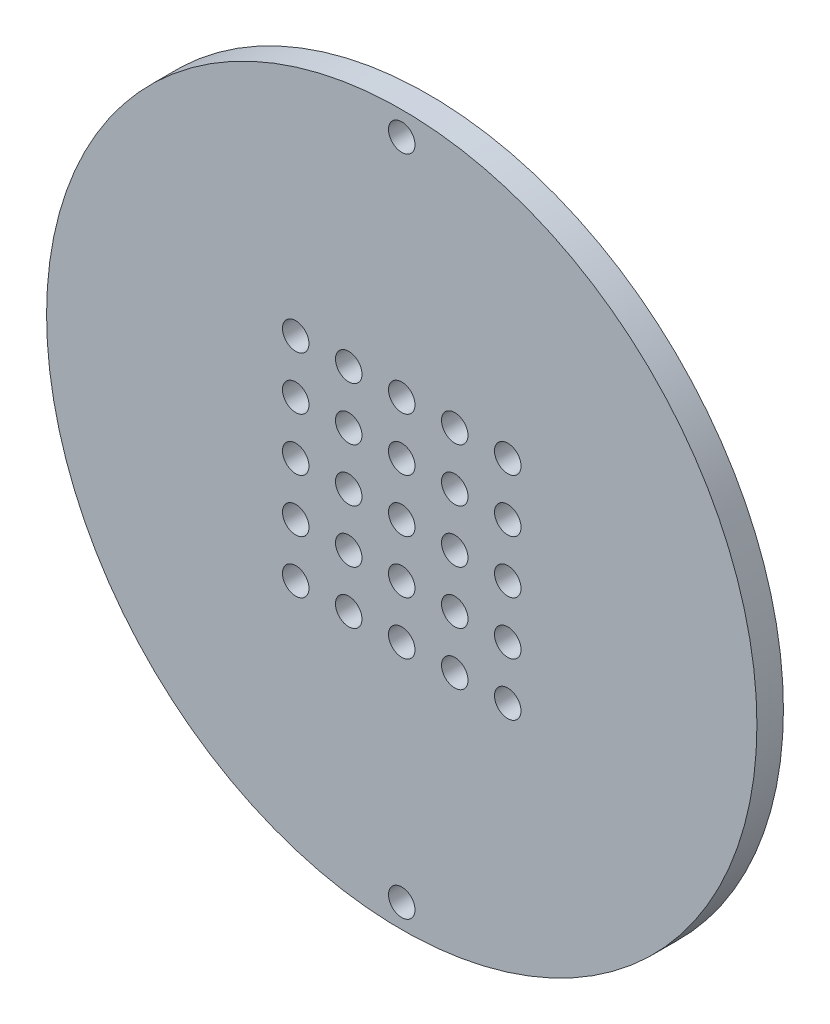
ISO-10303-21;
HEADER;
FILE_DESCRIPTION(('STEP AP214'),'2;1');
FILE_NAME('part.step','',(''),(''),'','','');
FILE_SCHEMA(('AUTOMOTIVE_DESIGN { 1 0 10303 214 1 1 1 1 }'));
ENDSEC;
DATA;
#1=APPLICATION_CONTEXT('core data for automotive mechanical design processes');
#2=APPLICATION_PROTOCOL_DEFINITION('international standard','automotive_design',2000,#1);
#3=PRODUCT_CONTEXT('',#1,'mechanical');
#4=PRODUCT('Part','Part','',(#3));
#5=PRODUCT_RELATED_PRODUCT_CATEGORY('part','',(#4));
#6=PRODUCT_DEFINITION_FORMATION('','',#4);
#7=PRODUCT_DEFINITION_CONTEXT('part definition',#1,'design');
#8=PRODUCT_DEFINITION('design','',#6,#7);
#9=PRODUCT_DEFINITION_SHAPE('','',#8);
#10=(LENGTH_UNIT() NAMED_UNIT(*) SI_UNIT(.MILLI.,.METRE.));
#11=(NAMED_UNIT(*) PLANE_ANGLE_UNIT() SI_UNIT($,.RADIAN.));
#12=(NAMED_UNIT(*) SI_UNIT($,.STERADIAN.) SOLID_ANGLE_UNIT());
#13=UNCERTAINTY_MEASURE_WITH_UNIT(LENGTH_MEASURE(1.E-05),#10,'distance_accuracy_value','');
#14=(GEOMETRIC_REPRESENTATION_CONTEXT(3) GLOBAL_UNCERTAINTY_ASSIGNED_CONTEXT((#13)) GLOBAL_UNIT_ASSIGNED_CONTEXT((#10,
#11,#12)) REPRESENTATION_CONTEXT('',''));
#15=CARTESIAN_POINT('',(0.,0.,0.));
#16=DIRECTION('',(0.,0.,1.));
#17=DIRECTION('',(1.,0.,0.));
#18=AXIS2_PLACEMENT_3D('',#15,#16,#17);
#19=CARTESIAN_POINT('',(0.,0.,6.35));
#20=DIRECTION('',(0.,0.,1.));
#21=DIRECTION('',(1.,0.,0.));
#22=AXIS2_PLACEMENT_3D('',#19,#20,#21);
#23=PLANE('',#22);
#24=CARTESIAN_POINT('',(0.,79.375,6.35));
#25=DIRECTION('',(0.,0.,1.));
#26=DIRECTION('',(1.,0.,0.));
#27=AXIS2_PLACEMENT_3D('',#24,#25,#26);
#28=CIRCLE('',#27,3.175);
#29=CARTESIAN_POINT('',(3.175,79.375,6.35));
#30=VERTEX_POINT('',#29);
#31=EDGE_CURVE('E107',#30,#30,#28,.F.);
#32=ORIENTED_EDGE('',*,*,#31,.T.);
#33=EDGE_LOOP('',(#32));
#34=FACE_BOUND('',#33,.T.);
#35=CARTESIAN_POINT('',(0.,-79.375,6.35));
#36=DIRECTION('',(0.,0.,1.));
#37=DIRECTION('',(1.,0.,0.));
#38=AXIS2_PLACEMENT_3D('',#35,#36,#37);
#39=CIRCLE('',#38,3.175);
#40=CARTESIAN_POINT('',(3.175,-79.375,6.35));
#41=VERTEX_POINT('',#40);
#42=EDGE_CURVE('E110',#41,#41,#39,.F.);
#43=ORIENTED_EDGE('',*,*,#42,.T.);
#44=EDGE_LOOP('',(#43));
#45=FACE_BOUND('',#44,.T.);
#46=CARTESIAN_POINT('',(0.,0.,6.35));
#47=DIRECTION('',(0.,0.,1.));
#48=DIRECTION('',(1.,0.,0.));
#49=AXIS2_PLACEMENT_3D('',#46,#47,#48);
#50=CIRCLE('',#49,3.175);
#51=CARTESIAN_POINT('',(3.175,0.,6.35));
#52=VERTEX_POINT('',#51);
#53=EDGE_CURVE('E113',#52,#52,#50,.F.);
#54=ORIENTED_EDGE('',*,*,#53,.T.);
#55=EDGE_LOOP('',(#54));
#56=FACE_BOUND('',#55,.T.);
#57=CARTESIAN_POINT('',(0.,-12.7,6.35));
#58=DIRECTION('',(0.,0.,1.));
#59=DIRECTION('',(1.,0.,0.));
#60=AXIS2_PLACEMENT_3D('',#57,#58,#59);
#61=CIRCLE('',#60,3.175);
#62=CARTESIAN_POINT('',(3.175,-12.7,6.35));
#63=VERTEX_POINT('',#62);
#64=EDGE_CURVE('E116',#63,#63,#61,.F.);
#65=ORIENTED_EDGE('',*,*,#64,.T.);
#66=EDGE_LOOP('',(#65));
#67=FACE_BOUND('',#66,.T.);
#68=CARTESIAN_POINT('',(0.,-25.4,6.35));
#69=DIRECTION('',(0.,0.,1.));
#70=DIRECTION('',(1.,0.,0.));
#71=AXIS2_PLACEMENT_3D('',#68,#69,#70);
#72=CIRCLE('',#71,3.175);
#73=CARTESIAN_POINT('',(3.175,-25.4,6.35));
#74=VERTEX_POINT('',#73);
#75=EDGE_CURVE('E119',#74,#74,#72,.F.);
#76=ORIENTED_EDGE('',*,*,#75,.T.);
#77=EDGE_LOOP('',(#76));
#78=FACE_BOUND('',#77,.T.);
#79=CARTESIAN_POINT('',(12.7,0.,6.35));
#80=DIRECTION('',(0.,0.,1.));
#81=DIRECTION('',(1.,0.,0.));
#82=AXIS2_PLACEMENT_3D('',#79,#80,#81);
#83=CIRCLE('',#82,3.175);
#84=CARTESIAN_POINT('',(15.875,0.,6.35));
#85=VERTEX_POINT('',#84);
#86=EDGE_CURVE('E122',#85,#85,#83,.F.);
#87=ORIENTED_EDGE('',*,*,#86,.T.);
#88=EDGE_LOOP('',(#87));
#89=FACE_BOUND('',#88,.T.);
#90=CARTESIAN_POINT('',(12.7,-12.7,6.35));
#91=DIRECTION('',(0.,0.,1.));
#92=DIRECTION('',(1.,0.,0.));
#93=AXIS2_PLACEMENT_3D('',#90,#91,#92);
#94=CIRCLE('',#93,3.175);
#95=CARTESIAN_POINT('',(15.875,-12.7,6.35));
#96=VERTEX_POINT('',#95);
#97=EDGE_CURVE('E125',#96,#96,#94,.F.);
#98=ORIENTED_EDGE('',*,*,#97,.T.);
#99=EDGE_LOOP('',(#98));
#100=FACE_BOUND('',#99,.T.);
#101=CARTESIAN_POINT('',(12.7,-25.4,6.35));
#102=DIRECTION('',(0.,0.,1.));
#103=DIRECTION('',(1.,0.,0.));
#104=AXIS2_PLACEMENT_3D('',#101,#102,#103);
#105=CIRCLE('',#104,3.175);
#106=CARTESIAN_POINT('',(15.875,-25.4,6.35));
#107=VERTEX_POINT('',#106);
#108=EDGE_CURVE('E128',#107,#107,#105,.F.);
#109=ORIENTED_EDGE('',*,*,#108,.T.);
#110=EDGE_LOOP('',(#109));
#111=FACE_BOUND('',#110,.T.);
#112=CARTESIAN_POINT('',(25.4,0.,6.35));
#113=DIRECTION('',(0.,0.,1.));
#114=DIRECTION('',(1.,0.,0.));
#115=AXIS2_PLACEMENT_3D('',#112,#113,#114);
#116=CIRCLE('',#115,3.175);
#117=CARTESIAN_POINT('',(28.575,0.,6.35));
#118=VERTEX_POINT('',#117);
#119=EDGE_CURVE('E131',#118,#118,#116,.F.);
#120=ORIENTED_EDGE('',*,*,#119,.T.);
#121=EDGE_LOOP('',(#120));
#122=FACE_BOUND('',#121,.T.);
#123=CARTESIAN_POINT('',(25.4,-12.7,6.35));
#124=DIRECTION('',(0.,0.,1.));
#125=DIRECTION('',(1.,0.,0.));
#126=AXIS2_PLACEMENT_3D('',#123,#124,#125);
#127=CIRCLE('',#126,3.175);
#128=CARTESIAN_POINT('',(28.575,-12.7,6.35));
#129=VERTEX_POINT('',#128);
#130=EDGE_CURVE('E134',#129,#129,#127,.F.);
#131=ORIENTED_EDGE('',*,*,#130,.T.);
#132=EDGE_LOOP('',(#131));
#133=FACE_BOUND('',#132,.T.);
#134=CARTESIAN_POINT('',(25.4,-25.4,6.35));
#135=DIRECTION('',(0.,0.,1.));
#136=DIRECTION('',(1.,0.,0.));
#137=AXIS2_PLACEMENT_3D('',#134,#135,#136);
#138=CIRCLE('',#137,3.175);
#139=CARTESIAN_POINT('',(28.575,-25.4,6.35));
#140=VERTEX_POINT('',#139);
#141=EDGE_CURVE('E137',#140,#140,#138,.F.);
#142=ORIENTED_EDGE('',*,*,#141,.T.);
#143=EDGE_LOOP('',(#142));
#144=FACE_BOUND('',#143,.T.);
#145=CARTESIAN_POINT('',(0.,12.7,6.35));
#146=DIRECTION('',(0.,0.,1.));
#147=DIRECTION('',(1.,0.,0.));
#148=AXIS2_PLACEMENT_3D('',#145,#146,#147);
#149=CIRCLE('',#148,3.175);
#150=CARTESIAN_POINT('',(3.175,12.7,6.35));
#151=VERTEX_POINT('',#150);
#152=EDGE_CURVE('E140',#151,#151,#149,.F.);
#153=ORIENTED_EDGE('',*,*,#152,.T.);
#154=EDGE_LOOP('',(#153));
#155=FACE_BOUND('',#154,.T.);
#156=CARTESIAN_POINT('',(0.,25.4,6.35));
#157=DIRECTION('',(0.,0.,1.));
#158=DIRECTION('',(1.,0.,0.));
#159=AXIS2_PLACEMENT_3D('',#156,#157,#158);
#160=CIRCLE('',#159,3.175);
#161=CARTESIAN_POINT('',(3.175,25.4,6.35));
#162=VERTEX_POINT('',#161);
#163=EDGE_CURVE('E143',#162,#162,#160,.F.);
#164=ORIENTED_EDGE('',*,*,#163,.T.);
#165=EDGE_LOOP('',(#164));
#166=FACE_BOUND('',#165,.T.);
#167=CARTESIAN_POINT('',(12.7,12.7,6.35));
#168=DIRECTION('',(0.,0.,1.));
#169=DIRECTION('',(1.,0.,0.));
#170=AXIS2_PLACEMENT_3D('',#167,#168,#169);
#171=CIRCLE('',#170,3.175);
#172=CARTESIAN_POINT('',(15.875,12.7,6.35));
#173=VERTEX_POINT('',#172);
#174=EDGE_CURVE('E146',#173,#173,#171,.F.);
#175=ORIENTED_EDGE('',*,*,#174,.T.);
#176=EDGE_LOOP('',(#175));
#177=FACE_BOUND('',#176,.T.);
#178=CARTESIAN_POINT('',(12.7,25.4,6.35));
#179=DIRECTION('',(0.,0.,1.));
#180=DIRECTION('',(1.,0.,0.));
#181=AXIS2_PLACEMENT_3D('',#178,#179,#180);
#182=CIRCLE('',#181,3.175);
#183=CARTESIAN_POINT('',(15.875,25.4,6.35));
#184=VERTEX_POINT('',#183);
#185=EDGE_CURVE('E149',#184,#184,#182,.F.);
#186=ORIENTED_EDGE('',*,*,#185,.T.);
#187=EDGE_LOOP('',(#186));
#188=FACE_BOUND('',#187,.T.);
#189=CARTESIAN_POINT('',(25.4,12.7,6.35));
#190=DIRECTION('',(0.,0.,1.));
#191=DIRECTION('',(1.,0.,0.));
#192=AXIS2_PLACEMENT_3D('',#189,#190,#191);
#193=CIRCLE('',#192,3.175);
#194=CARTESIAN_POINT('',(28.575,12.7,6.35));
#195=VERTEX_POINT('',#194);
#196=EDGE_CURVE('E152',#195,#195,#193,.F.);
#197=ORIENTED_EDGE('',*,*,#196,.T.);
#198=EDGE_LOOP('',(#197));
#199=FACE_BOUND('',#198,.T.);
#200=CARTESIAN_POINT('',(25.4,25.4,6.35));
#201=DIRECTION('',(0.,0.,1.));
#202=DIRECTION('',(1.,0.,0.));
#203=AXIS2_PLACEMENT_3D('',#200,#201,#202);
#204=CIRCLE('',#203,3.175);
#205=CARTESIAN_POINT('',(28.575,25.4,6.35));
#206=VERTEX_POINT('',#205);
#207=EDGE_CURVE('E155',#206,#206,#204,.F.);
#208=ORIENTED_EDGE('',*,*,#207,.T.);
#209=EDGE_LOOP('',(#208));
#210=FACE_BOUND('',#209,.T.);
#211=CARTESIAN_POINT('',(-12.7,25.4,6.35));
#212=DIRECTION('',(0.,0.,1.));
#213=DIRECTION('',(1.,0.,0.));
#214=AXIS2_PLACEMENT_3D('',#211,#212,#213);
#215=CIRCLE('',#214,3.175);
#216=CARTESIAN_POINT('',(-9.525,25.4,6.35));
#217=VERTEX_POINT('',#216);
#218=EDGE_CURVE('E158',#217,#217,#215,.F.);
#219=ORIENTED_EDGE('',*,*,#218,.T.);
#220=EDGE_LOOP('',(#219));
#221=FACE_BOUND('',#220,.T.);
#222=CARTESIAN_POINT('',(-12.7,12.7,6.35));
#223=DIRECTION('',(0.,0.,1.));
#224=DIRECTION('',(1.,0.,0.));
#225=AXIS2_PLACEMENT_3D('',#222,#223,#224);
#226=CIRCLE('',#225,3.175);
#227=CARTESIAN_POINT('',(-9.525,12.7,6.35));
#228=VERTEX_POINT('',#227);
#229=EDGE_CURVE('E161',#228,#228,#226,.F.);
#230=ORIENTED_EDGE('',*,*,#229,.T.);
#231=EDGE_LOOP('',(#230));
#232=FACE_BOUND('',#231,.T.);
#233=CARTESIAN_POINT('',(-12.7,0.,6.35));
#234=DIRECTION('',(0.,0.,1.));
#235=DIRECTION('',(1.,0.,0.));
#236=AXIS2_PLACEMENT_3D('',#233,#234,#235);
#237=CIRCLE('',#236,3.175);
#238=CARTESIAN_POINT('',(-9.525,0.,6.35));
#239=VERTEX_POINT('',#238);
#240=EDGE_CURVE('E164',#239,#239,#237,.F.);
#241=ORIENTED_EDGE('',*,*,#240,.T.);
#242=EDGE_LOOP('',(#241));
#243=FACE_BOUND('',#242,.T.);
#244=CARTESIAN_POINT('',(-12.7,-12.7,6.35));
#245=DIRECTION('',(0.,0.,1.));
#246=DIRECTION('',(1.,0.,0.));
#247=AXIS2_PLACEMENT_3D('',#244,#245,#246);
#248=CIRCLE('',#247,3.175);
#249=CARTESIAN_POINT('',(-9.525,-12.7,6.35));
#250=VERTEX_POINT('',#249);
#251=EDGE_CURVE('E167',#250,#250,#248,.F.);
#252=ORIENTED_EDGE('',*,*,#251,.T.);
#253=EDGE_LOOP('',(#252));
#254=FACE_BOUND('',#253,.T.);
#255=CARTESIAN_POINT('',(-12.7,-25.4,6.35));
#256=DIRECTION('',(0.,0.,1.));
#257=DIRECTION('',(1.,0.,0.));
#258=AXIS2_PLACEMENT_3D('',#255,#256,#257);
#259=CIRCLE('',#258,3.175);
#260=CARTESIAN_POINT('',(-9.525,-25.4,6.35));
#261=VERTEX_POINT('',#260);
#262=EDGE_CURVE('E170',#261,#261,#259,.F.);
#263=ORIENTED_EDGE('',*,*,#262,.T.);
#264=EDGE_LOOP('',(#263));
#265=FACE_BOUND('',#264,.T.);
#266=CARTESIAN_POINT('',(-25.4,25.4,6.35));
#267=DIRECTION('',(0.,0.,1.));
#268=DIRECTION('',(1.,0.,0.));
#269=AXIS2_PLACEMENT_3D('',#266,#267,#268);
#270=CIRCLE('',#269,3.175);
#271=CARTESIAN_POINT('',(-22.225,25.4,6.35));
#272=VERTEX_POINT('',#271);
#273=EDGE_CURVE('E173',#272,#272,#270,.F.);
#274=ORIENTED_EDGE('',*,*,#273,.T.);
#275=EDGE_LOOP('',(#274));
#276=FACE_BOUND('',#275,.T.);
#277=CARTESIAN_POINT('',(-25.4,12.7,6.35));
#278=DIRECTION('',(0.,0.,1.));
#279=DIRECTION('',(1.,0.,0.));
#280=AXIS2_PLACEMENT_3D('',#277,#278,#279);
#281=CIRCLE('',#280,3.175);
#282=CARTESIAN_POINT('',(-22.225,12.7,6.35));
#283=VERTEX_POINT('',#282);
#284=EDGE_CURVE('E176',#283,#283,#281,.F.);
#285=ORIENTED_EDGE('',*,*,#284,.T.);
#286=EDGE_LOOP('',(#285));
#287=FACE_BOUND('',#286,.T.);
#288=CARTESIAN_POINT('',(-25.4,0.,6.35));
#289=DIRECTION('',(0.,0.,1.));
#290=DIRECTION('',(1.,0.,0.));
#291=AXIS2_PLACEMENT_3D('',#288,#289,#290);
#292=CIRCLE('',#291,3.175);
#293=CARTESIAN_POINT('',(-22.225,0.,6.35));
#294=VERTEX_POINT('',#293);
#295=EDGE_CURVE('E179',#294,#294,#292,.F.);
#296=ORIENTED_EDGE('',*,*,#295,.T.);
#297=EDGE_LOOP('',(#296));
#298=FACE_BOUND('',#297,.T.);
#299=CARTESIAN_POINT('',(-25.4,-12.7,6.35));
#300=DIRECTION('',(0.,0.,1.));
#301=DIRECTION('',(1.,0.,0.));
#302=AXIS2_PLACEMENT_3D('',#299,#300,#301);
#303=CIRCLE('',#302,3.175);
#304=CARTESIAN_POINT('',(-22.225,-12.7,6.35));
#305=VERTEX_POINT('',#304);
#306=EDGE_CURVE('E182',#305,#305,#303,.F.);
#307=ORIENTED_EDGE('',*,*,#306,.T.);
#308=EDGE_LOOP('',(#307));
#309=FACE_BOUND('',#308,.T.);
#310=CARTESIAN_POINT('',(-25.4,-25.4,6.35));
#311=DIRECTION('',(0.,0.,1.));
#312=DIRECTION('',(1.,0.,0.));
#313=AXIS2_PLACEMENT_3D('',#310,#311,#312);
#314=CIRCLE('',#313,3.175);
#315=CARTESIAN_POINT('',(-22.225,-25.4,6.35));
#316=VERTEX_POINT('',#315);
#317=EDGE_CURVE('E184',#316,#316,#314,.F.);
#318=ORIENTED_EDGE('',*,*,#317,.T.);
#319=EDGE_LOOP('',(#318));
#320=FACE_BOUND('',#319,.T.);
#321=CARTESIAN_POINT('',(0.,0.,6.35));
#322=DIRECTION('',(0.,0.,1.));
#323=DIRECTION('',(1.,0.,0.));
#324=AXIS2_PLACEMENT_3D('',#321,#322,#323);
#325=CIRCLE('',#324,85.09);
#326=CARTESIAN_POINT('',(85.09,0.,6.35));
#327=VERTEX_POINT('',#326);
#328=EDGE_CURVE('E18',#327,#327,#325,.F.);
#329=ORIENTED_EDGE('',*,*,#328,.F.);
#330=EDGE_LOOP('',(#329));
#331=FACE_BOUND('',#330,.T.);
#332=ADVANCED_FACE('F15',(#34,#45,#56,#67,#78,#89,#100,#111,#122,#133,#144,#155,#166,#177,#188,
#199,#210,#221,#232,#243,#254,#265,#276,#287,#298,#309,#320,#331),#23,.T.);
#333=CARTESIAN_POINT('',(0.,0.,0.));
#334=DIRECTION('',(0.,0.,1.));
#335=DIRECTION('',(1.,0.,0.));
#336=AXIS2_PLACEMENT_3D('',#333,#334,#335);
#337=CYLINDRICAL_SURFACE('',#336,85.09);
#338=CARTESIAN_POINT('',(0.,0.,0.));
#339=DIRECTION('',(0.,0.,1.));
#340=DIRECTION('',(1.,0.,0.));
#341=AXIS2_PLACEMENT_3D('',#338,#339,#340);
#342=CIRCLE('',#341,85.09);
#343=CARTESIAN_POINT('',(85.09,0.,0.));
#344=VERTEX_POINT('',#343);
#345=EDGE_CURVE('E104',#344,#344,#342,.T.);
#346=ORIENTED_EDGE('',*,*,#345,.T.);
#347=EDGE_LOOP('',(#346));
#348=FACE_BOUND('',#347,.T.);
#349=ORIENTED_EDGE('',*,*,#328,.T.);
#350=EDGE_LOOP('',(#349));
#351=FACE_BOUND('',#350,.T.);
#352=ADVANCED_FACE('F191',(#348,#351),#337,.T.);
#353=CARTESIAN_POINT('',(-25.4,-25.4,0.));
#354=DIRECTION('',(0.,0.,1.));
#355=DIRECTION('',(1.,0.,0.));
#356=AXIS2_PLACEMENT_3D('',#353,#354,#355);
#357=CYLINDRICAL_SURFACE('',#356,3.175);
#358=CARTESIAN_POINT('',(-25.4,-25.4,0.));
#359=DIRECTION('',(0.,0.,1.));
#360=DIRECTION('',(1.,0.,0.));
#361=AXIS2_PLACEMENT_3D('',#358,#359,#360);
#362=CIRCLE('',#361,3.175);
#363=CARTESIAN_POINT('',(-22.225,-25.4,0.));
#364=VERTEX_POINT('',#363);
#365=EDGE_CURVE('E101',#364,#364,#362,.F.);
#366=ORIENTED_EDGE('',*,*,#365,.T.);
#367=EDGE_LOOP('',(#366));
#368=FACE_BOUND('',#367,.T.);
#369=ORIENTED_EDGE('',*,*,#317,.F.);
#370=EDGE_LOOP('',(#369));
#371=FACE_BOUND('',#370,.T.);
#372=ADVANCED_FACE('F199',(#368,#371),#357,.F.);
#373=CARTESIAN_POINT('',(-25.4,-12.7,0.));
#374=DIRECTION('',(0.,0.,1.));
#375=DIRECTION('',(1.,0.,0.));
#376=AXIS2_PLACEMENT_3D('',#373,#374,#375);
#377=CYLINDRICAL_SURFACE('',#376,3.175);
#378=CARTESIAN_POINT('',(-25.4,-12.7,0.));
#379=DIRECTION('',(0.,0.,1.));
#380=DIRECTION('',(1.,0.,0.));
#381=AXIS2_PLACEMENT_3D('',#378,#379,#380);
#382=CIRCLE('',#381,3.175);
#383=CARTESIAN_POINT('',(-22.225,-12.7,0.));
#384=VERTEX_POINT('',#383);
#385=EDGE_CURVE('E98',#384,#384,#382,.F.);
#386=ORIENTED_EDGE('',*,*,#385,.T.);
#387=EDGE_LOOP('',(#386));
#388=FACE_BOUND('',#387,.T.);
#389=ORIENTED_EDGE('',*,*,#306,.F.);
#390=EDGE_LOOP('',(#389));
#391=FACE_BOUND('',#390,.T.);
#392=ADVANCED_FACE('F308',(#388,#391),#377,.F.);
#393=CARTESIAN_POINT('',(-25.4,0.,0.));
#394=DIRECTION('',(0.,0.,1.));
#395=DIRECTION('',(1.,0.,0.));
#396=AXIS2_PLACEMENT_3D('',#393,#394,#395);
#397=CYLINDRICAL_SURFACE('',#396,3.175);
#398=CARTESIAN_POINT('',(-25.4,0.,0.));
#399=DIRECTION('',(0.,0.,1.));
#400=DIRECTION('',(1.,0.,0.));
#401=AXIS2_PLACEMENT_3D('',#398,#399,#400);
#402=CIRCLE('',#401,3.175);
#403=CARTESIAN_POINT('',(-22.225,0.,0.));
#404=VERTEX_POINT('',#403);
#405=EDGE_CURVE('E95',#404,#404,#402,.F.);
#406=ORIENTED_EDGE('',*,*,#405,.T.);
#407=EDGE_LOOP('',(#406));
#408=FACE_BOUND('',#407,.T.);
#409=ORIENTED_EDGE('',*,*,#295,.F.);
#410=EDGE_LOOP('',(#409));
#411=FACE_BOUND('',#410,.T.);
#412=ADVANCED_FACE('F304',(#408,#411),#397,.F.);
#413=CARTESIAN_POINT('',(-25.4,12.7,0.));
#414=DIRECTION('',(0.,0.,1.));
#415=DIRECTION('',(1.,0.,0.));
#416=AXIS2_PLACEMENT_3D('',#413,#414,#415);
#417=CYLINDRICAL_SURFACE('',#416,3.175);
#418=CARTESIAN_POINT('',(-25.4,12.7,0.));
#419=DIRECTION('',(0.,0.,1.));
#420=DIRECTION('',(1.,0.,0.));
#421=AXIS2_PLACEMENT_3D('',#418,#419,#420);
#422=CIRCLE('',#421,3.175);
#423=CARTESIAN_POINT('',(-22.225,12.7,0.));
#424=VERTEX_POINT('',#423);
#425=EDGE_CURVE('E92',#424,#424,#422,.F.);
#426=ORIENTED_EDGE('',*,*,#425,.T.);
#427=EDGE_LOOP('',(#426));
#428=FACE_BOUND('',#427,.T.);
#429=ORIENTED_EDGE('',*,*,#284,.F.);
#430=EDGE_LOOP('',(#429));
#431=FACE_BOUND('',#430,.T.);
#432=ADVANCED_FACE('F300',(#428,#431),#417,.F.);
#433=CARTESIAN_POINT('',(-25.4,25.4,0.));
#434=DIRECTION('',(0.,0.,1.));
#435=DIRECTION('',(1.,0.,0.));
#436=AXIS2_PLACEMENT_3D('',#433,#434,#435);
#437=CYLINDRICAL_SURFACE('',#436,3.175);
#438=CARTESIAN_POINT('',(-25.4,25.4,0.));
#439=DIRECTION('',(0.,0.,1.));
#440=DIRECTION('',(1.,0.,0.));
#441=AXIS2_PLACEMENT_3D('',#438,#439,#440);
#442=CIRCLE('',#441,3.175);
#443=CARTESIAN_POINT('',(-22.225,25.4,0.));
#444=VERTEX_POINT('',#443);
#445=EDGE_CURVE('E89',#444,#444,#442,.F.);
#446=ORIENTED_EDGE('',*,*,#445,.T.);
#447=EDGE_LOOP('',(#446));
#448=FACE_BOUND('',#447,.T.);
#449=ORIENTED_EDGE('',*,*,#273,.F.);
#450=EDGE_LOOP('',(#449));
#451=FACE_BOUND('',#450,.T.);
#452=ADVANCED_FACE('F296',(#448,#451),#437,.F.);
#453=CARTESIAN_POINT('',(-12.7,-25.4,0.));
#454=DIRECTION('',(0.,0.,1.));
#455=DIRECTION('',(1.,0.,0.));
#456=AXIS2_PLACEMENT_3D('',#453,#454,#455);
#457=CYLINDRICAL_SURFACE('',#456,3.175);
#458=CARTESIAN_POINT('',(-12.7,-25.4,0.));
#459=DIRECTION('',(0.,0.,1.));
#460=DIRECTION('',(1.,0.,0.));
#461=AXIS2_PLACEMENT_3D('',#458,#459,#460);
#462=CIRCLE('',#461,3.175);
#463=CARTESIAN_POINT('',(-9.525,-25.4,0.));
#464=VERTEX_POINT('',#463);
#465=EDGE_CURVE('E86',#464,#464,#462,.F.);
#466=ORIENTED_EDGE('',*,*,#465,.T.);
#467=EDGE_LOOP('',(#466));
#468=FACE_BOUND('',#467,.T.);
#469=ORIENTED_EDGE('',*,*,#262,.F.);
#470=EDGE_LOOP('',(#469));
#471=FACE_BOUND('',#470,.T.);
#472=ADVANCED_FACE('F292',(#468,#471),#457,.F.);
#473=CARTESIAN_POINT('',(-12.7,-12.7,0.));
#474=DIRECTION('',(0.,0.,1.));
#475=DIRECTION('',(1.,0.,0.));
#476=AXIS2_PLACEMENT_3D('',#473,#474,#475);
#477=CYLINDRICAL_SURFACE('',#476,3.175);
#478=CARTESIAN_POINT('',(-12.7,-12.7,0.));
#479=DIRECTION('',(0.,0.,1.));
#480=DIRECTION('',(1.,0.,0.));
#481=AXIS2_PLACEMENT_3D('',#478,#479,#480);
#482=CIRCLE('',#481,3.175);
#483=CARTESIAN_POINT('',(-9.525,-12.7,0.));
#484=VERTEX_POINT('',#483);
#485=EDGE_CURVE('E83',#484,#484,#482,.F.);
#486=ORIENTED_EDGE('',*,*,#485,.T.);
#487=EDGE_LOOP('',(#486));
#488=FACE_BOUND('',#487,.T.);
#489=ORIENTED_EDGE('',*,*,#251,.F.);
#490=EDGE_LOOP('',(#489));
#491=FACE_BOUND('',#490,.T.);
#492=ADVANCED_FACE('F288',(#488,#491),#477,.F.);
#493=CARTESIAN_POINT('',(-12.7,0.,0.));
#494=DIRECTION('',(0.,0.,1.));
#495=DIRECTION('',(1.,0.,0.));
#496=AXIS2_PLACEMENT_3D('',#493,#494,#495);
#497=CYLINDRICAL_SURFACE('',#496,3.175);
#498=CARTESIAN_POINT('',(-12.7,0.,0.));
#499=DIRECTION('',(0.,0.,1.));
#500=DIRECTION('',(1.,0.,0.));
#501=AXIS2_PLACEMENT_3D('',#498,#499,#500);
#502=CIRCLE('',#501,3.175);
#503=CARTESIAN_POINT('',(-9.525,0.,0.));
#504=VERTEX_POINT('',#503);
#505=EDGE_CURVE('E80',#504,#504,#502,.F.);
#506=ORIENTED_EDGE('',*,*,#505,.T.);
#507=EDGE_LOOP('',(#506));
#508=FACE_BOUND('',#507,.T.);
#509=ORIENTED_EDGE('',*,*,#240,.F.);
#510=EDGE_LOOP('',(#509));
#511=FACE_BOUND('',#510,.T.);
#512=ADVANCED_FACE('F284',(#508,#511),#497,.F.);
#513=CARTESIAN_POINT('',(-12.7,12.7,0.));
#514=DIRECTION('',(0.,0.,1.));
#515=DIRECTION('',(1.,0.,0.));
#516=AXIS2_PLACEMENT_3D('',#513,#514,#515);
#517=CYLINDRICAL_SURFACE('',#516,3.175);
#518=CARTESIAN_POINT('',(-12.7,12.7,0.));
#519=DIRECTION('',(0.,0.,1.));
#520=DIRECTION('',(1.,0.,0.));
#521=AXIS2_PLACEMENT_3D('',#518,#519,#520);
#522=CIRCLE('',#521,3.175);
#523=CARTESIAN_POINT('',(-9.525,12.7,0.));
#524=VERTEX_POINT('',#523);
#525=EDGE_CURVE('E77',#524,#524,#522,.F.);
#526=ORIENTED_EDGE('',*,*,#525,.T.);
#527=EDGE_LOOP('',(#526));
#528=FACE_BOUND('',#527,.T.);
#529=ORIENTED_EDGE('',*,*,#229,.F.);
#530=EDGE_LOOP('',(#529));
#531=FACE_BOUND('',#530,.T.);
#532=ADVANCED_FACE('F280',(#528,#531),#517,.F.);
#533=CARTESIAN_POINT('',(-12.7,25.4,0.));
#534=DIRECTION('',(0.,0.,1.));
#535=DIRECTION('',(1.,0.,0.));
#536=AXIS2_PLACEMENT_3D('',#533,#534,#535);
#537=CYLINDRICAL_SURFACE('',#536,3.175);
#538=CARTESIAN_POINT('',(-12.7,25.4,0.));
#539=DIRECTION('',(0.,0.,1.));
#540=DIRECTION('',(1.,0.,0.));
#541=AXIS2_PLACEMENT_3D('',#538,#539,#540);
#542=CIRCLE('',#541,3.175);
#543=CARTESIAN_POINT('',(-9.525,25.4,0.));
#544=VERTEX_POINT('',#543);
#545=EDGE_CURVE('E74',#544,#544,#542,.F.);
#546=ORIENTED_EDGE('',*,*,#545,.T.);
#547=EDGE_LOOP('',(#546));
#548=FACE_BOUND('',#547,.T.);
#549=ORIENTED_EDGE('',*,*,#218,.F.);
#550=EDGE_LOOP('',(#549));
#551=FACE_BOUND('',#550,.T.);
#552=ADVANCED_FACE('F276',(#548,#551),#537,.F.);
#553=CARTESIAN_POINT('',(25.4,25.4,0.));
#554=DIRECTION('',(0.,0.,1.));
#555=DIRECTION('',(1.,0.,0.));
#556=AXIS2_PLACEMENT_3D('',#553,#554,#555);
#557=CYLINDRICAL_SURFACE('',#556,3.175);
#558=CARTESIAN_POINT('',(25.4,25.4,0.));
#559=DIRECTION('',(0.,0.,1.));
#560=DIRECTION('',(1.,0.,0.));
#561=AXIS2_PLACEMENT_3D('',#558,#559,#560);
#562=CIRCLE('',#561,3.175);
#563=CARTESIAN_POINT('',(28.575,25.4,0.));
#564=VERTEX_POINT('',#563);
#565=EDGE_CURVE('E71',#564,#564,#562,.F.);
#566=ORIENTED_EDGE('',*,*,#565,.T.);
#567=EDGE_LOOP('',(#566));
#568=FACE_BOUND('',#567,.T.);
#569=ORIENTED_EDGE('',*,*,#207,.F.);
#570=EDGE_LOOP('',(#569));
#571=FACE_BOUND('',#570,.T.);
#572=ADVANCED_FACE('F272',(#568,#571),#557,.F.);
#573=CARTESIAN_POINT('',(25.4,12.7,0.));
#574=DIRECTION('',(0.,0.,1.));
#575=DIRECTION('',(1.,0.,0.));
#576=AXIS2_PLACEMENT_3D('',#573,#574,#575);
#577=CYLINDRICAL_SURFACE('',#576,3.175);
#578=CARTESIAN_POINT('',(25.4,12.7,0.));
#579=DIRECTION('',(0.,0.,1.));
#580=DIRECTION('',(1.,0.,0.));
#581=AXIS2_PLACEMENT_3D('',#578,#579,#580);
#582=CIRCLE('',#581,3.175);
#583=CARTESIAN_POINT('',(28.575,12.7,0.));
#584=VERTEX_POINT('',#583);
#585=EDGE_CURVE('E68',#584,#584,#582,.F.);
#586=ORIENTED_EDGE('',*,*,#585,.T.);
#587=EDGE_LOOP('',(#586));
#588=FACE_BOUND('',#587,.T.);
#589=ORIENTED_EDGE('',*,*,#196,.F.);
#590=EDGE_LOOP('',(#589));
#591=FACE_BOUND('',#590,.T.);
#592=ADVANCED_FACE('F268',(#588,#591),#577,.F.);
#593=CARTESIAN_POINT('',(12.7,25.4,0.));
#594=DIRECTION('',(0.,0.,1.));
#595=DIRECTION('',(1.,0.,0.));
#596=AXIS2_PLACEMENT_3D('',#593,#594,#595);
#597=CYLINDRICAL_SURFACE('',#596,3.175);
#598=CARTESIAN_POINT('',(12.7,25.4,0.));
#599=DIRECTION('',(0.,0.,1.));
#600=DIRECTION('',(1.,0.,0.));
#601=AXIS2_PLACEMENT_3D('',#598,#599,#600);
#602=CIRCLE('',#601,3.175);
#603=CARTESIAN_POINT('',(15.875,25.4,0.));
#604=VERTEX_POINT('',#603);
#605=EDGE_CURVE('E65',#604,#604,#602,.F.);
#606=ORIENTED_EDGE('',*,*,#605,.T.);
#607=EDGE_LOOP('',(#606));
#608=FACE_BOUND('',#607,.T.);
#609=ORIENTED_EDGE('',*,*,#185,.F.);
#610=EDGE_LOOP('',(#609));
#611=FACE_BOUND('',#610,.T.);
#612=ADVANCED_FACE('F264',(#608,#611),#597,.F.);
#613=CARTESIAN_POINT('',(12.7,12.7,0.));
#614=DIRECTION('',(0.,0.,1.));
#615=DIRECTION('',(1.,0.,0.));
#616=AXIS2_PLACEMENT_3D('',#613,#614,#615);
#617=CYLINDRICAL_SURFACE('',#616,3.175);
#618=CARTESIAN_POINT('',(12.7,12.7,0.));
#619=DIRECTION('',(0.,0.,1.));
#620=DIRECTION('',(1.,0.,0.));
#621=AXIS2_PLACEMENT_3D('',#618,#619,#620);
#622=CIRCLE('',#621,3.175);
#623=CARTESIAN_POINT('',(15.875,12.7,0.));
#624=VERTEX_POINT('',#623);
#625=EDGE_CURVE('E62',#624,#624,#622,.F.);
#626=ORIENTED_EDGE('',*,*,#625,.T.);
#627=EDGE_LOOP('',(#626));
#628=FACE_BOUND('',#627,.T.);
#629=ORIENTED_EDGE('',*,*,#174,.F.);
#630=EDGE_LOOP('',(#629));
#631=FACE_BOUND('',#630,.T.);
#632=ADVANCED_FACE('F260',(#628,#631),#617,.F.);
#633=CARTESIAN_POINT('',(0.,25.4,0.));
#634=DIRECTION('',(0.,0.,1.));
#635=DIRECTION('',(1.,0.,0.));
#636=AXIS2_PLACEMENT_3D('',#633,#634,#635);
#637=CYLINDRICAL_SURFACE('',#636,3.175);
#638=CARTESIAN_POINT('',(0.,25.4,0.));
#639=DIRECTION('',(0.,0.,1.));
#640=DIRECTION('',(1.,0.,0.));
#641=AXIS2_PLACEMENT_3D('',#638,#639,#640);
#642=CIRCLE('',#641,3.175);
#643=CARTESIAN_POINT('',(3.175,25.4,0.));
#644=VERTEX_POINT('',#643);
#645=EDGE_CURVE('E59',#644,#644,#642,.F.);
#646=ORIENTED_EDGE('',*,*,#645,.T.);
#647=EDGE_LOOP('',(#646));
#648=FACE_BOUND('',#647,.T.);
#649=ORIENTED_EDGE('',*,*,#163,.F.);
#650=EDGE_LOOP('',(#649));
#651=FACE_BOUND('',#650,.T.);
#652=ADVANCED_FACE('F256',(#648,#651),#637,.F.);
#653=CARTESIAN_POINT('',(0.,12.7,0.));
#654=DIRECTION('',(0.,0.,1.));
#655=DIRECTION('',(1.,0.,0.));
#656=AXIS2_PLACEMENT_3D('',#653,#654,#655);
#657=CYLINDRICAL_SURFACE('',#656,3.175);
#658=CARTESIAN_POINT('',(0.,12.7,0.));
#659=DIRECTION('',(0.,0.,1.));
#660=DIRECTION('',(1.,0.,0.));
#661=AXIS2_PLACEMENT_3D('',#658,#659,#660);
#662=CIRCLE('',#661,3.175);
#663=CARTESIAN_POINT('',(3.175,12.7,0.));
#664=VERTEX_POINT('',#663);
#665=EDGE_CURVE('E56',#664,#664,#662,.F.);
#666=ORIENTED_EDGE('',*,*,#665,.T.);
#667=EDGE_LOOP('',(#666));
#668=FACE_BOUND('',#667,.T.);
#669=ORIENTED_EDGE('',*,*,#152,.F.);
#670=EDGE_LOOP('',(#669));
#671=FACE_BOUND('',#670,.T.);
#672=ADVANCED_FACE('F252',(#668,#671),#657,.F.);
#673=CARTESIAN_POINT('',(25.4,-25.4,0.));
#674=DIRECTION('',(0.,0.,1.));
#675=DIRECTION('',(1.,0.,0.));
#676=AXIS2_PLACEMENT_3D('',#673,#674,#675);
#677=CYLINDRICAL_SURFACE('',#676,3.175);
#678=CARTESIAN_POINT('',(25.4,-25.4,0.));
#679=DIRECTION('',(0.,0.,1.));
#680=DIRECTION('',(1.,0.,0.));
#681=AXIS2_PLACEMENT_3D('',#678,#679,#680);
#682=CIRCLE('',#681,3.175);
#683=CARTESIAN_POINT('',(28.575,-25.4,0.));
#684=VERTEX_POINT('',#683);
#685=EDGE_CURVE('E53',#684,#684,#682,.F.);
#686=ORIENTED_EDGE('',*,*,#685,.T.);
#687=EDGE_LOOP('',(#686));
#688=FACE_BOUND('',#687,.T.);
#689=ORIENTED_EDGE('',*,*,#141,.F.);
#690=EDGE_LOOP('',(#689));
#691=FACE_BOUND('',#690,.T.);
#692=ADVANCED_FACE('F248',(#688,#691),#677,.F.);
#693=CARTESIAN_POINT('',(25.4,-12.7,0.));
#694=DIRECTION('',(0.,0.,1.));
#695=DIRECTION('',(1.,0.,0.));
#696=AXIS2_PLACEMENT_3D('',#693,#694,#695);
#697=CYLINDRICAL_SURFACE('',#696,3.175);
#698=CARTESIAN_POINT('',(25.4,-12.7,0.));
#699=DIRECTION('',(0.,0.,1.));
#700=DIRECTION('',(1.,0.,0.));
#701=AXIS2_PLACEMENT_3D('',#698,#699,#700);
#702=CIRCLE('',#701,3.175);
#703=CARTESIAN_POINT('',(28.575,-12.7,0.));
#704=VERTEX_POINT('',#703);
#705=EDGE_CURVE('E50',#704,#704,#702,.F.);
#706=ORIENTED_EDGE('',*,*,#705,.T.);
#707=EDGE_LOOP('',(#706));
#708=FACE_BOUND('',#707,.T.);
#709=ORIENTED_EDGE('',*,*,#130,.F.);
#710=EDGE_LOOP('',(#709));
#711=FACE_BOUND('',#710,.T.);
#712=ADVANCED_FACE('F244',(#708,#711),#697,.F.);
#713=CARTESIAN_POINT('',(25.4,0.,0.));
#714=DIRECTION('',(0.,0.,1.));
#715=DIRECTION('',(1.,0.,0.));
#716=AXIS2_PLACEMENT_3D('',#713,#714,#715);
#717=CYLINDRICAL_SURFACE('',#716,3.175);
#718=CARTESIAN_POINT('',(25.4,0.,0.));
#719=DIRECTION('',(0.,0.,1.));
#720=DIRECTION('',(1.,0.,0.));
#721=AXIS2_PLACEMENT_3D('',#718,#719,#720);
#722=CIRCLE('',#721,3.175);
#723=CARTESIAN_POINT('',(28.575,0.,0.));
#724=VERTEX_POINT('',#723);
#725=EDGE_CURVE('E47',#724,#724,#722,.F.);
#726=ORIENTED_EDGE('',*,*,#725,.T.);
#727=EDGE_LOOP('',(#726));
#728=FACE_BOUND('',#727,.T.);
#729=ORIENTED_EDGE('',*,*,#119,.F.);
#730=EDGE_LOOP('',(#729));
#731=FACE_BOUND('',#730,.T.);
#732=ADVANCED_FACE('F240',(#728,#731),#717,.F.);
#733=CARTESIAN_POINT('',(12.7,-25.4,0.));
#734=DIRECTION('',(0.,0.,1.));
#735=DIRECTION('',(1.,0.,0.));
#736=AXIS2_PLACEMENT_3D('',#733,#734,#735);
#737=CYLINDRICAL_SURFACE('',#736,3.175);
#738=CARTESIAN_POINT('',(12.7,-25.4,0.));
#739=DIRECTION('',(0.,0.,1.));
#740=DIRECTION('',(1.,0.,0.));
#741=AXIS2_PLACEMENT_3D('',#738,#739,#740);
#742=CIRCLE('',#741,3.175);
#743=CARTESIAN_POINT('',(15.875,-25.4,0.));
#744=VERTEX_POINT('',#743);
#745=EDGE_CURVE('E44',#744,#744,#742,.F.);
#746=ORIENTED_EDGE('',*,*,#745,.T.);
#747=EDGE_LOOP('',(#746));
#748=FACE_BOUND('',#747,.T.);
#749=ORIENTED_EDGE('',*,*,#108,.F.);
#750=EDGE_LOOP('',(#749));
#751=FACE_BOUND('',#750,.T.);
#752=ADVANCED_FACE('F236',(#748,#751),#737,.F.);
#753=CARTESIAN_POINT('',(12.7,-12.7,0.));
#754=DIRECTION('',(0.,0.,1.));
#755=DIRECTION('',(1.,0.,0.));
#756=AXIS2_PLACEMENT_3D('',#753,#754,#755);
#757=CYLINDRICAL_SURFACE('',#756,3.175);
#758=CARTESIAN_POINT('',(12.7,-12.7,0.));
#759=DIRECTION('',(0.,0.,1.));
#760=DIRECTION('',(1.,0.,0.));
#761=AXIS2_PLACEMENT_3D('',#758,#759,#760);
#762=CIRCLE('',#761,3.175);
#763=CARTESIAN_POINT('',(15.875,-12.7,0.));
#764=VERTEX_POINT('',#763);
#765=EDGE_CURVE('E41',#764,#764,#762,.F.);
#766=ORIENTED_EDGE('',*,*,#765,.T.);
#767=EDGE_LOOP('',(#766));
#768=FACE_BOUND('',#767,.T.);
#769=ORIENTED_EDGE('',*,*,#97,.F.);
#770=EDGE_LOOP('',(#769));
#771=FACE_BOUND('',#770,.T.);
#772=ADVANCED_FACE('F232',(#768,#771),#757,.F.);
#773=CARTESIAN_POINT('',(12.7,0.,0.));
#774=DIRECTION('',(0.,0.,1.));
#775=DIRECTION('',(1.,0.,0.));
#776=AXIS2_PLACEMENT_3D('',#773,#774,#775);
#777=CYLINDRICAL_SURFACE('',#776,3.175);
#778=CARTESIAN_POINT('',(12.7,0.,0.));
#779=DIRECTION('',(0.,0.,1.));
#780=DIRECTION('',(1.,0.,0.));
#781=AXIS2_PLACEMENT_3D('',#778,#779,#780);
#782=CIRCLE('',#781,3.175);
#783=CARTESIAN_POINT('',(15.875,0.,0.));
#784=VERTEX_POINT('',#783);
#785=EDGE_CURVE('E38',#784,#784,#782,.F.);
#786=ORIENTED_EDGE('',*,*,#785,.T.);
#787=EDGE_LOOP('',(#786));
#788=FACE_BOUND('',#787,.T.);
#789=ORIENTED_EDGE('',*,*,#86,.F.);
#790=EDGE_LOOP('',(#789));
#791=FACE_BOUND('',#790,.T.);
#792=ADVANCED_FACE('F228',(#788,#791),#777,.F.);
#793=CARTESIAN_POINT('',(0.,-25.4,0.));
#794=DIRECTION('',(0.,0.,1.));
#795=DIRECTION('',(1.,0.,0.));
#796=AXIS2_PLACEMENT_3D('',#793,#794,#795);
#797=CYLINDRICAL_SURFACE('',#796,3.175);
#798=CARTESIAN_POINT('',(0.,-25.4,0.));
#799=DIRECTION('',(0.,0.,1.));
#800=DIRECTION('',(1.,0.,0.));
#801=AXIS2_PLACEMENT_3D('',#798,#799,#800);
#802=CIRCLE('',#801,3.175);
#803=CARTESIAN_POINT('',(3.175,-25.4,0.));
#804=VERTEX_POINT('',#803);
#805=EDGE_CURVE('E35',#804,#804,#802,.F.);
#806=ORIENTED_EDGE('',*,*,#805,.T.);
#807=EDGE_LOOP('',(#806));
#808=FACE_BOUND('',#807,.T.);
#809=ORIENTED_EDGE('',*,*,#75,.F.);
#810=EDGE_LOOP('',(#809));
#811=FACE_BOUND('',#810,.T.);
#812=ADVANCED_FACE('F224',(#808,#811),#797,.F.);
#813=CARTESIAN_POINT('',(0.,-12.7,0.));
#814=DIRECTION('',(0.,0.,1.));
#815=DIRECTION('',(1.,0.,0.));
#816=AXIS2_PLACEMENT_3D('',#813,#814,#815);
#817=CYLINDRICAL_SURFACE('',#816,3.175);
#818=CARTESIAN_POINT('',(0.,-12.7,0.));
#819=DIRECTION('',(0.,0.,1.));
#820=DIRECTION('',(1.,0.,0.));
#821=AXIS2_PLACEMENT_3D('',#818,#819,#820);
#822=CIRCLE('',#821,3.175);
#823=CARTESIAN_POINT('',(3.175,-12.7,0.));
#824=VERTEX_POINT('',#823);
#825=EDGE_CURVE('E32',#824,#824,#822,.F.);
#826=ORIENTED_EDGE('',*,*,#825,.T.);
#827=EDGE_LOOP('',(#826));
#828=FACE_BOUND('',#827,.T.);
#829=ORIENTED_EDGE('',*,*,#64,.F.);
#830=EDGE_LOOP('',(#829));
#831=FACE_BOUND('',#830,.T.);
#832=ADVANCED_FACE('F220',(#828,#831),#817,.F.);
#833=CARTESIAN_POINT('',(0.,0.,0.));
#834=DIRECTION('',(0.,0.,1.));
#835=DIRECTION('',(1.,0.,0.));
#836=AXIS2_PLACEMENT_3D('',#833,#834,#835);
#837=CYLINDRICAL_SURFACE('',#836,3.175);
#838=CARTESIAN_POINT('',(0.,0.,0.));
#839=DIRECTION('',(0.,0.,1.));
#840=DIRECTION('',(1.,0.,0.));
#841=AXIS2_PLACEMENT_3D('',#838,#839,#840);
#842=CIRCLE('',#841,3.175);
#843=CARTESIAN_POINT('',(3.175,0.,0.));
#844=VERTEX_POINT('',#843);
#845=EDGE_CURVE('E27',#844,#844,#842,.F.);
#846=ORIENTED_EDGE('',*,*,#845,.T.);
#847=EDGE_LOOP('',(#846));
#848=FACE_BOUND('',#847,.T.);
#849=ORIENTED_EDGE('',*,*,#53,.F.);
#850=EDGE_LOOP('',(#849));
#851=FACE_BOUND('',#850,.T.);
#852=ADVANCED_FACE('F216',(#848,#851),#837,.F.);
#853=CARTESIAN_POINT('',(0.,-79.375,0.));
#854=DIRECTION('',(0.,0.,1.));
#855=DIRECTION('',(1.,0.,0.));
#856=AXIS2_PLACEMENT_3D('',#853,#854,#855);
#857=CYLINDRICAL_SURFACE('',#856,3.175);
#858=CARTESIAN_POINT('',(0.,-79.375,0.));
#859=DIRECTION('',(0.,0.,1.));
#860=DIRECTION('',(1.,0.,0.));
#861=AXIS2_PLACEMENT_3D('',#858,#859,#860);
#862=CIRCLE('',#861,3.175);
#863=CARTESIAN_POINT('',(3.175,-79.375,0.));
#864=VERTEX_POINT('',#863);
#865=EDGE_CURVE('E22',#864,#864,#862,.F.);
#866=ORIENTED_EDGE('',*,*,#865,.T.);
#867=EDGE_LOOP('',(#866));
#868=FACE_BOUND('',#867,.T.);
#869=ORIENTED_EDGE('',*,*,#42,.F.);
#870=EDGE_LOOP('',(#869));
#871=FACE_BOUND('',#870,.T.);
#872=ADVANCED_FACE('F210',(#868,#871),#857,.F.);
#873=CARTESIAN_POINT('',(0.,79.375,0.));
#874=DIRECTION('',(0.,0.,1.));
#875=DIRECTION('',(1.,0.,0.));
#876=AXIS2_PLACEMENT_3D('',#873,#874,#875);
#877=CYLINDRICAL_SURFACE('',#876,3.175);
#878=CARTESIAN_POINT('',(0.,79.375,0.));
#879=DIRECTION('',(0.,0.,1.));
#880=DIRECTION('',(1.,0.,0.));
#881=AXIS2_PLACEMENT_3D('',#878,#879,#880);
#882=CIRCLE('',#881,3.175);
#883=CARTESIAN_POINT('',(3.175,79.375,0.));
#884=VERTEX_POINT('',#883);
#885=EDGE_CURVE('E10',#884,#884,#882,.F.);
#886=ORIENTED_EDGE('',*,*,#885,.T.);
#887=EDGE_LOOP('',(#886));
#888=FACE_BOUND('',#887,.T.);
#889=ORIENTED_EDGE('',*,*,#31,.F.);
#890=EDGE_LOOP('',(#889));
#891=FACE_BOUND('',#890,.T.);
#892=ADVANCED_FACE('F204',(#888,#891),#877,.F.);
#893=CARTESIAN_POINT('',(0.,0.,0.));
#894=DIRECTION('',(0.,0.,1.));
#895=DIRECTION('',(1.,0.,0.));
#896=AXIS2_PLACEMENT_3D('',#893,#894,#895);
#897=PLANE('',#896);
#898=ORIENTED_EDGE('',*,*,#885,.F.);
#899=EDGE_LOOP('',(#898));
#900=FACE_BOUND('',#899,.T.);
#901=ORIENTED_EDGE('',*,*,#865,.F.);
#902=EDGE_LOOP('',(#901));
#903=FACE_BOUND('',#902,.T.);
#904=ORIENTED_EDGE('',*,*,#845,.F.);
#905=EDGE_LOOP('',(#904));
#906=FACE_BOUND('',#905,.T.);
#907=ORIENTED_EDGE('',*,*,#825,.F.);
#908=EDGE_LOOP('',(#907));
#909=FACE_BOUND('',#908,.T.);
#910=ORIENTED_EDGE('',*,*,#805,.F.);
#911=EDGE_LOOP('',(#910));
#912=FACE_BOUND('',#911,.T.);
#913=ORIENTED_EDGE('',*,*,#785,.F.);
#914=EDGE_LOOP('',(#913));
#915=FACE_BOUND('',#914,.T.);
#916=ORIENTED_EDGE('',*,*,#765,.F.);
#917=EDGE_LOOP('',(#916));
#918=FACE_BOUND('',#917,.T.);
#919=ORIENTED_EDGE('',*,*,#745,.F.);
#920=EDGE_LOOP('',(#919));
#921=FACE_BOUND('',#920,.T.);
#922=ORIENTED_EDGE('',*,*,#725,.F.);
#923=EDGE_LOOP('',(#922));
#924=FACE_BOUND('',#923,.T.);
#925=ORIENTED_EDGE('',*,*,#705,.F.);
#926=EDGE_LOOP('',(#925));
#927=FACE_BOUND('',#926,.T.);
#928=ORIENTED_EDGE('',*,*,#685,.F.);
#929=EDGE_LOOP('',(#928));
#930=FACE_BOUND('',#929,.T.);
#931=ORIENTED_EDGE('',*,*,#665,.F.);
#932=EDGE_LOOP('',(#931));
#933=FACE_BOUND('',#932,.T.);
#934=ORIENTED_EDGE('',*,*,#645,.F.);
#935=EDGE_LOOP('',(#934));
#936=FACE_BOUND('',#935,.T.);
#937=ORIENTED_EDGE('',*,*,#625,.F.);
#938=EDGE_LOOP('',(#937));
#939=FACE_BOUND('',#938,.T.);
#940=ORIENTED_EDGE('',*,*,#605,.F.);
#941=EDGE_LOOP('',(#940));
#942=FACE_BOUND('',#941,.T.);
#943=ORIENTED_EDGE('',*,*,#585,.F.);
#944=EDGE_LOOP('',(#943));
#945=FACE_BOUND('',#944,.T.);
#946=ORIENTED_EDGE('',*,*,#565,.F.);
#947=EDGE_LOOP('',(#946));
#948=FACE_BOUND('',#947,.T.);
#949=ORIENTED_EDGE('',*,*,#545,.F.);
#950=EDGE_LOOP('',(#949));
#951=FACE_BOUND('',#950,.T.);
#952=ORIENTED_EDGE('',*,*,#525,.F.);
#953=EDGE_LOOP('',(#952));
#954=FACE_BOUND('',#953,.T.);
#955=ORIENTED_EDGE('',*,*,#505,.F.);
#956=EDGE_LOOP('',(#955));
#957=FACE_BOUND('',#956,.T.);
#958=ORIENTED_EDGE('',*,*,#485,.F.);
#959=EDGE_LOOP('',(#958));
#960=FACE_BOUND('',#959,.T.);
#961=ORIENTED_EDGE('',*,*,#465,.F.);
#962=EDGE_LOOP('',(#961));
#963=FACE_BOUND('',#962,.T.);
#964=ORIENTED_EDGE('',*,*,#445,.F.);
#965=EDGE_LOOP('',(#964));
#966=FACE_BOUND('',#965,.T.);
#967=ORIENTED_EDGE('',*,*,#425,.F.);
#968=EDGE_LOOP('',(#967));
#969=FACE_BOUND('',#968,.T.);
#970=ORIENTED_EDGE('',*,*,#405,.F.);
#971=EDGE_LOOP('',(#970));
#972=FACE_BOUND('',#971,.T.);
#973=ORIENTED_EDGE('',*,*,#385,.F.);
#974=EDGE_LOOP('',(#973));
#975=FACE_BOUND('',#974,.T.);
#976=ORIENTED_EDGE('',*,*,#365,.F.);
#977=EDGE_LOOP('',(#976));
#978=FACE_BOUND('',#977,.T.);
#979=ORIENTED_EDGE('',*,*,#345,.F.);
#980=EDGE_LOOP('',(#979));
#981=FACE_BOUND('',#980,.T.);
#982=ADVANCED_FACE('F202',(#900,#903,#906,#909,#912,#915,#918,#921,#924,#927,#930,#933,#936,
#939,#942,#945,#948,#951,#954,#957,#960,#963,#966,#969,#972,#975,#978,#981),#897,.F.);
#983=CLOSED_SHELL('',(#332,#352,#372,#392,#412,#432,#452,#472,#492,#512,#532,#552,#572,#592,
#612,#632,#652,#672,#692,#712,#732,#752,#772,#792,#812,#832,#852,#872,#892,#982));
#984=MANIFOLD_SOLID_BREP('B1',#983);
#985=ADVANCED_BREP_SHAPE_REPRESENTATION('',(#18,#984),#14);
#986=SHAPE_DEFINITION_REPRESENTATION(#9,#985);
ENDSEC;
END-ISO-10303-21;
